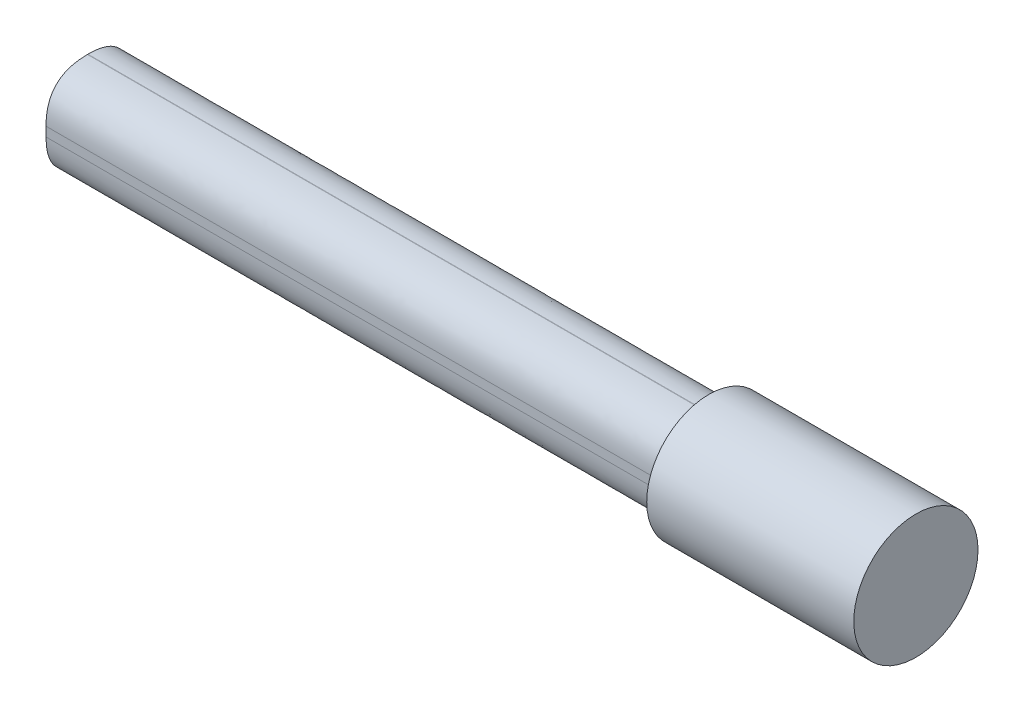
ISO-10303-21;
HEADER;
FILE_DESCRIPTION(('STEP AP214'),'2;1');
FILE_NAME('part.step','',(''),(''),'','','');
FILE_SCHEMA(('AUTOMOTIVE_DESIGN { 1 0 10303 214 1 1 1 1 }'));
ENDSEC;
DATA;
#1=APPLICATION_CONTEXT('core data for automotive mechanical design processes');
#2=APPLICATION_PROTOCOL_DEFINITION('international standard','automotive_design',2000,#1);
#3=PRODUCT_CONTEXT('',#1,'mechanical');
#4=PRODUCT('Part','Part','',(#3));
#5=PRODUCT_RELATED_PRODUCT_CATEGORY('part','',(#4));
#6=PRODUCT_DEFINITION_FORMATION('','',#4);
#7=PRODUCT_DEFINITION_CONTEXT('part definition',#1,'design');
#8=PRODUCT_DEFINITION('design','',#6,#7);
#9=PRODUCT_DEFINITION_SHAPE('','',#8);
#10=(LENGTH_UNIT() NAMED_UNIT(*) SI_UNIT(.MILLI.,.METRE.));
#11=(NAMED_UNIT(*) PLANE_ANGLE_UNIT() SI_UNIT($,.RADIAN.));
#12=(NAMED_UNIT(*) SI_UNIT($,.STERADIAN.) SOLID_ANGLE_UNIT());
#13=UNCERTAINTY_MEASURE_WITH_UNIT(LENGTH_MEASURE(1.E-05),#10,'distance_accuracy_value','');
#14=(GEOMETRIC_REPRESENTATION_CONTEXT(3) GLOBAL_UNCERTAINTY_ASSIGNED_CONTEXT((#13)) GLOBAL_UNIT_ASSIGNED_CONTEXT((#10,
#11,#12)) REPRESENTATION_CONTEXT('',''));
#15=CARTESIAN_POINT('',(0.,0.,0.));
#16=DIRECTION('',(0.,0.,1.));
#17=DIRECTION('',(1.,0.,0.));
#18=AXIS2_PLACEMENT_3D('',#15,#16,#17);
#19=CARTESIAN_POINT('',(0.,0.,0.));
#20=DIRECTION('',(1.,0.,0.));
#21=DIRECTION('',(0.,0.,-1.));
#22=AXIS2_PLACEMENT_3D('',#19,#20,#21);
#23=PLANE('',#22);
#24=CARTESIAN_POINT('',(0.,0.,0.));
#25=DIRECTION('',(1.,0.,0.));
#26=DIRECTION('',(0.,0.,-1.));
#27=AXIS2_PLACEMENT_3D('',#24,#25,#26);
#28=CIRCLE('',#27,3.81);
#29=CARTESIAN_POINT('',(0.,2.8250273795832,2.55642725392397));
#30=VERTEX_POINT('',#29);
#31=CARTESIAN_POINT('',(0.,-2.82502737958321,2.55642725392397));
#32=VERTEX_POINT('',#31);
#33=EDGE_CURVE('E122',#30,#32,#28,.T.);
#34=ORIENTED_EDGE('',*,*,#33,.F.);
#35=CARTESIAN_POINT('',(0.,2.8250273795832,-2.55642725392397));
#36=VERTEX_POINT('',#35);
#37=EDGE_CURVE('E127',#36,#30,#28,.T.);
#38=ORIENTED_EDGE('',*,*,#37,.F.);
#39=CARTESIAN_POINT('',(0.,-2.82502737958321,-2.55642725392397));
#40=VERTEX_POINT('',#39);
#41=EDGE_CURVE('E131',#40,#36,#28,.T.);
#42=ORIENTED_EDGE('',*,*,#41,.F.);
#43=EDGE_CURVE('E125',#32,#40,#28,.T.);
#44=ORIENTED_EDGE('',*,*,#43,.F.);
#45=EDGE_LOOP('',(#34,#38,#42,#44));
#46=FACE_BOUND('',#45,.T.);
#47=DIRECTION('',(0.,1.,0.));
#48=VECTOR('',#47,1.);
#49=CARTESIAN_POINT('',(0.,2.8250273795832,2.55642725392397));
#50=LINE('',#49,#48);
#51=CARTESIAN_POINT('',(0.,-0.285027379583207,2.55642725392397));
#52=VERTEX_POINT('',#51);
#53=CARTESIAN_POINT('',(0.,0.285027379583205,2.55642725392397));
#54=VERTEX_POINT('',#53);
#55=EDGE_CURVE('E59',#52,#54,#50,.T.);
#56=ORIENTED_EDGE('',*,*,#55,.F.);
#57=CARTESIAN_POINT('',(0.,-2.82502737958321,0.0164272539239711));
#58=CARTESIAN_POINT('',(0.,-2.82502737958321,2.55642725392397));
#59=CARTESIAN_POINT('',(0.,-0.285027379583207,2.55642725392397));
#60=(BOUNDED_CURVE() B_SPLINE_CURVE(2,(#57,#58,#59),.UNSPECIFIED.,.F.,
.F.) B_SPLINE_CURVE_WITH_KNOTS((3,3),(0.,1.),
.UNSPECIFIED.) CURVE() GEOMETRIC_REPRESENTATION_ITEM() RATIONAL_B_SPLINE_CURVE((1.,1.,1.)) REPRESENTATION_ITEM(''));
#61=CARTESIAN_POINT('',(0.,-2.82502737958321,0.0164272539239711));
#62=VERTEX_POINT('',#61);
#63=EDGE_CURVE('E192',#52,#62,#60,.F.);
#64=ORIENTED_EDGE('',*,*,#63,.T.);
#65=DIRECTION('',(0.,0.,1.));
#66=VECTOR('',#65,1.);
#67=CARTESIAN_POINT('',(0.,-2.82502737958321,2.55642725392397));
#68=LINE('',#67,#66);
#69=CARTESIAN_POINT('',(0.,-2.82502737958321,-0.0164272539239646));
#70=VERTEX_POINT('',#69);
#71=EDGE_CURVE('E139',#70,#62,#68,.T.);
#72=ORIENTED_EDGE('',*,*,#71,.F.);
#73=CARTESIAN_POINT('',(0.,-0.285027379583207,-2.55642725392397));
#74=CARTESIAN_POINT('',(0.,-2.82502737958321,-2.55642725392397));
#75=CARTESIAN_POINT('',(0.,-2.82502737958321,-0.0164272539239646));
#76=(BOUNDED_CURVE() B_SPLINE_CURVE(2,(#73,#74,#75),.UNSPECIFIED.,.F.,
.F.) B_SPLINE_CURVE_WITH_KNOTS((3,3),(0.,1.),
.UNSPECIFIED.) CURVE() GEOMETRIC_REPRESENTATION_ITEM() RATIONAL_B_SPLINE_CURVE((1.,1.,1.)) REPRESENTATION_ITEM(''));
#77=CARTESIAN_POINT('',(0.,-0.285027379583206,-2.55642725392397));
#78=VERTEX_POINT('',#77);
#79=EDGE_CURVE('E447',#70,#78,#76,.F.);
#80=ORIENTED_EDGE('',*,*,#79,.T.);
#81=DIRECTION('',(0.,-1.,0.));
#82=VECTOR('',#81,1.);
#83=CARTESIAN_POINT('',(0.,2.8250273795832,-2.55642725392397));
#84=LINE('',#83,#82);
#85=CARTESIAN_POINT('',(0.,0.285027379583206,-2.55642725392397));
#86=VERTEX_POINT('',#85);
#87=EDGE_CURVE('E362',#86,#78,#84,.T.);
#88=ORIENTED_EDGE('',*,*,#87,.F.);
#89=CARTESIAN_POINT('',(0.,2.8250273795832,-0.0164272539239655));
#90=CARTESIAN_POINT('',(0.,2.8250273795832,-2.55642725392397));
#91=CARTESIAN_POINT('',(0.,0.285027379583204,-2.55642725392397));
#92=(BOUNDED_CURVE() B_SPLINE_CURVE(2,(#89,#90,#91),.UNSPECIFIED.,.F.,
.F.) B_SPLINE_CURVE_WITH_KNOTS((3,3),(0.,1.),
.UNSPECIFIED.) CURVE() GEOMETRIC_REPRESENTATION_ITEM() RATIONAL_B_SPLINE_CURVE((1.,1.,1.)) REPRESENTATION_ITEM(''));
#93=CARTESIAN_POINT('',(0.,2.8250273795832,-0.0164272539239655));
#94=VERTEX_POINT('',#93);
#95=EDGE_CURVE('E52',#86,#94,#92,.F.);
#96=ORIENTED_EDGE('',*,*,#95,.T.);
#97=DIRECTION('',(0.,0.,-1.));
#98=VECTOR('',#97,1.);
#99=CARTESIAN_POINT('',(0.,2.8250273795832,2.55642725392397));
#100=LINE('',#99,#98);
#101=CARTESIAN_POINT('',(0.,2.8250273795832,0.0164272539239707));
#102=VERTEX_POINT('',#101);
#103=EDGE_CURVE('E66',#102,#94,#100,.T.);
#104=ORIENTED_EDGE('',*,*,#103,.F.);
#105=CARTESIAN_POINT('',(0.,0.285027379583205,2.55642725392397));
#106=CARTESIAN_POINT('',(0.,2.8250273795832,2.55642725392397));
#107=CARTESIAN_POINT('',(0.,2.8250273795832,0.0164272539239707));
#108=(BOUNDED_CURVE() B_SPLINE_CURVE(2,(#105,#106,#107),.UNSPECIFIED.,.F.,
.F.) B_SPLINE_CURVE_WITH_KNOTS((3,3),(0.,1.),
.UNSPECIFIED.) CURVE() GEOMETRIC_REPRESENTATION_ITEM() RATIONAL_B_SPLINE_CURVE((1.,1.,1.)) REPRESENTATION_ITEM(''));
#109=EDGE_CURVE('E12',#102,#54,#108,.F.);
#110=ORIENTED_EDGE('',*,*,#109,.T.);
#111=EDGE_LOOP('',(#56,#64,#72,#80,#88,#96,#104,#110));
#112=FACE_BOUND('',#111,.T.);
#113=ADVANCED_FACE('F38',(#46,#112),#23,.F.);
#114=CARTESIAN_POINT('',(12.7,0.,0.));
#115=DIRECTION('',(-1.,0.,0.));
#116=DIRECTION('',(0.,0.,1.));
#117=AXIS2_PLACEMENT_3D('',#114,#115,#116);
#118=CYLINDRICAL_SURFACE('',#117,3.81);
#119=CARTESIAN_POINT('',(12.7,0.,0.));
#120=DIRECTION('',(1.,0.,0.));
#121=DIRECTION('',(0.,0.,-1.));
#122=AXIS2_PLACEMENT_3D('',#119,#120,#121);
#123=CIRCLE('',#122,3.81);
#124=CARTESIAN_POINT('',(12.7,0.,-3.81));
#125=VERTEX_POINT('',#124);
#126=EDGE_CURVE('E135',#125,#125,#123,.T.);
#127=ORIENTED_EDGE('',*,*,#126,.F.);
#128=EDGE_LOOP('',(#127));
#129=FACE_BOUND('',#128,.T.);
#130=ORIENTED_EDGE('',*,*,#37,.T.);
#131=ORIENTED_EDGE('',*,*,#33,.T.);
#132=ORIENTED_EDGE('',*,*,#43,.T.);
#133=ORIENTED_EDGE('',*,*,#41,.T.);
#134=EDGE_LOOP('',(#130,#131,#132,#133));
#135=FACE_BOUND('',#134,.T.);
#136=ADVANCED_FACE('F124',(#129,#135),#118,.T.);
#137=CARTESIAN_POINT('',(12.7,0.,0.));
#138=DIRECTION('',(1.,0.,0.));
#139=DIRECTION('',(0.,0.,-1.));
#140=AXIS2_PLACEMENT_3D('',#137,#138,#139);
#141=PLANE('',#140);
#142=ORIENTED_EDGE('',*,*,#126,.T.);
#143=EDGE_LOOP('',(#142));
#144=FACE_BOUND('',#143,.T.);
#145=ADVANCED_FACE('F209',(#144),#141,.T.);
#146=CARTESIAN_POINT('',(-38.1,2.8250273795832,-2.55642725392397));
#147=DIRECTION('',(0.,0.,1.));
#148=DIRECTION('',(0.,-1.,0.));
#149=AXIS2_PLACEMENT_3D('',#146,#147,#148);
#150=PLANE('',#149);
#151=ORIENTED_EDGE('',*,*,#87,.T.);
#152=CARTESIAN_POINT('',(-40.005,-0.285027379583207,-2.55642725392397));
#153=CARTESIAN_POINT('',(-26.035,-0.285027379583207,-2.55642725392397));
#154=CARTESIAN_POINT('',(-12.065,-0.285027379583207,-2.55642725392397));
#155=CARTESIAN_POINT('',(1.905,-0.285027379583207,-2.55642725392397));
#156=(BOUNDED_CURVE() B_SPLINE_CURVE(3,(#152,#153,#154,#155),.UNSPECIFIED.,.F.,
.F.) B_SPLINE_CURVE_WITH_KNOTS((4,4),(-0.001905,0.040005),
.UNSPECIFIED.) CURVE() GEOMETRIC_REPRESENTATION_ITEM() RATIONAL_B_SPLINE_CURVE((1.,1.,1.,1.)) REPRESENTATION_ITEM(''));
#157=CARTESIAN_POINT('',(-38.1,-0.285027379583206,-2.55642725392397));
#158=VERTEX_POINT('',#157);
#159=EDGE_CURVE('E451',#78,#158,#156,.F.);
#160=ORIENTED_EDGE('',*,*,#159,.T.);
#161=DIRECTION('',(0.,-1.,0.));
#162=VECTOR('',#161,1.);
#163=CARTESIAN_POINT('',(-38.1,2.8250273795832,-2.55642725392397));
#164=LINE('',#163,#162);
#165=CARTESIAN_POINT('',(-38.1,0.285027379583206,-2.55642725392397));
#166=VERTEX_POINT('',#165);
#167=EDGE_CURVE('E151',#166,#158,#164,.T.);
#168=ORIENTED_EDGE('',*,*,#167,.F.);
#169=CARTESIAN_POINT('',(1.905,0.285027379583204,-2.55642725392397));
#170=CARTESIAN_POINT('',(-12.065,0.285027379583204,-2.55642725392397));
#171=CARTESIAN_POINT('',(-26.035,0.285027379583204,-2.55642725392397));
#172=CARTESIAN_POINT('',(-40.005,0.285027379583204,-2.55642725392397));
#173=(BOUNDED_CURVE() B_SPLINE_CURVE(3,(#169,#170,#171,#172),.UNSPECIFIED.,.F.,
.F.) B_SPLINE_CURVE_WITH_KNOTS((4,4),(-0.001905,0.040005),
.UNSPECIFIED.) CURVE() GEOMETRIC_REPRESENTATION_ITEM() RATIONAL_B_SPLINE_CURVE((1.,1.,1.,1.)) REPRESENTATION_ITEM(''));
#174=EDGE_CURVE('E326',#166,#86,#173,.F.);
#175=ORIENTED_EDGE('',*,*,#174,.T.);
#176=EDGE_LOOP('',(#151,#160,#168,#175));
#177=FACE_BOUND('',#176,.T.);
#178=ADVANCED_FACE('F417',(#177),#150,.F.);
#179=CARTESIAN_POINT('',(-38.1,-2.82502737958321,2.55642725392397));
#180=DIRECTION('',(0.,1.,0.));
#181=DIRECTION('',(0.,0.,1.));
#182=AXIS2_PLACEMENT_3D('',#179,#180,#181);
#183=PLANE('',#182);
#184=ORIENTED_EDGE('',*,*,#71,.T.);
#185=CARTESIAN_POINT('',(-40.005,-2.82502737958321,0.0164272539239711));
#186=CARTESIAN_POINT('',(-26.035,-2.82502737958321,0.0164272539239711));
#187=CARTESIAN_POINT('',(-12.065,-2.82502737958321,0.0164272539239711));
#188=CARTESIAN_POINT('',(1.905,-2.82502737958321,0.0164272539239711));
#189=(BOUNDED_CURVE() B_SPLINE_CURVE(3,(#185,#186,#187,#188),.UNSPECIFIED.,.F.,
.F.) B_SPLINE_CURVE_WITH_KNOTS((4,4),(-0.001905,0.040005),
.UNSPECIFIED.) CURVE() GEOMETRIC_REPRESENTATION_ITEM() RATIONAL_B_SPLINE_CURVE((1.,1.,1.,1.)) REPRESENTATION_ITEM(''));
#190=CARTESIAN_POINT('',(-38.1,-2.82502737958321,0.0164272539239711));
#191=VERTEX_POINT('',#190);
#192=EDGE_CURVE('E334',#62,#191,#189,.F.);
#193=ORIENTED_EDGE('',*,*,#192,.T.);
#194=DIRECTION('',(0.,0.,1.));
#195=VECTOR('',#194,1.);
#196=CARTESIAN_POINT('',(-38.1,-2.82502737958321,2.55642725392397));
#197=LINE('',#196,#195);
#198=CARTESIAN_POINT('',(-38.1,-2.82502737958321,-0.0164272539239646));
#199=VERTEX_POINT('',#198);
#200=EDGE_CURVE('E363',#199,#191,#197,.T.);
#201=ORIENTED_EDGE('',*,*,#200,.F.);
#202=CARTESIAN_POINT('',(1.905,-2.82502737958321,-0.0164272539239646));
#203=CARTESIAN_POINT('',(-12.065,-2.82502737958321,-0.0164272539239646));
#204=CARTESIAN_POINT('',(-26.035,-2.82502737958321,-0.0164272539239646));
#205=CARTESIAN_POINT('',(-40.005,-2.82502737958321,-0.0164272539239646));
#206=(BOUNDED_CURVE() B_SPLINE_CURVE(3,(#202,#203,#204,#205),.UNSPECIFIED.,.F.,
.F.) B_SPLINE_CURVE_WITH_KNOTS((4,4),(-0.001905,0.040005),
.UNSPECIFIED.) CURVE() GEOMETRIC_REPRESENTATION_ITEM() RATIONAL_B_SPLINE_CURVE((1.,1.,1.,1.)) REPRESENTATION_ITEM(''));
#207=EDGE_CURVE('E336',#199,#70,#206,.F.);
#208=ORIENTED_EDGE('',*,*,#207,.T.);
#209=EDGE_LOOP('',(#184,#193,#201,#208));
#210=FACE_BOUND('',#209,.T.);
#211=ADVANCED_FACE('F425',(#210),#183,.F.);
#212=CARTESIAN_POINT('',(-38.1,2.8250273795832,2.55642725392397));
#213=DIRECTION('',(0.,0.,-1.));
#214=DIRECTION('',(0.,1.,0.));
#215=AXIS2_PLACEMENT_3D('',#212,#213,#214);
#216=PLANE('',#215);
#217=DIRECTION('',(0.,1.,0.));
#218=VECTOR('',#217,1.);
#219=CARTESIAN_POINT('',(-38.1,2.8250273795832,2.55642725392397));
#220=LINE('',#219,#218);
#221=CARTESIAN_POINT('',(-38.1,-0.285027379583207,2.55642725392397));
#222=VERTEX_POINT('',#221);
#223=CARTESIAN_POINT('',(-38.1,0.285027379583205,2.55642725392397));
#224=VERTEX_POINT('',#223);
#225=EDGE_CURVE('E140',#222,#224,#220,.T.);
#226=ORIENTED_EDGE('',*,*,#225,.F.);
#227=CARTESIAN_POINT('',(1.905,-0.285027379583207,2.55642725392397));
#228=CARTESIAN_POINT('',(-12.065,-0.285027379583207,2.55642725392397));
#229=CARTESIAN_POINT('',(-26.035,-0.285027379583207,2.55642725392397));
#230=CARTESIAN_POINT('',(-40.005,-0.285027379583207,2.55642725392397));
#231=(BOUNDED_CURVE() B_SPLINE_CURVE(3,(#227,#228,#229,#230),.UNSPECIFIED.,.F.,
.F.) B_SPLINE_CURVE_WITH_KNOTS((4,4),(-0.001905,0.040005),
.UNSPECIFIED.) CURVE() GEOMETRIC_REPRESENTATION_ITEM() RATIONAL_B_SPLINE_CURVE((1.,1.,1.,1.)) REPRESENTATION_ITEM(''));
#232=EDGE_CURVE('E246',#222,#52,#231,.F.);
#233=ORIENTED_EDGE('',*,*,#232,.T.);
#234=ORIENTED_EDGE('',*,*,#55,.T.);
#235=CARTESIAN_POINT('',(-40.005,0.285027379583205,2.55642725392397));
#236=CARTESIAN_POINT('',(-26.035,0.285027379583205,2.55642725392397));
#237=CARTESIAN_POINT('',(-12.065,0.285027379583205,2.55642725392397));
#238=CARTESIAN_POINT('',(1.905,0.285027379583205,2.55642725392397));
#239=(BOUNDED_CURVE() B_SPLINE_CURVE(3,(#235,#236,#237,#238),.UNSPECIFIED.,.F.,
.F.) B_SPLINE_CURVE_WITH_KNOTS((4,4),(-0.001905,0.040005),
.UNSPECIFIED.) CURVE() GEOMETRIC_REPRESENTATION_ITEM() RATIONAL_B_SPLINE_CURVE((1.,1.,1.,1.)) REPRESENTATION_ITEM(''));
#240=EDGE_CURVE('E241',#54,#224,#239,.F.);
#241=ORIENTED_EDGE('',*,*,#240,.T.);
#242=EDGE_LOOP('',(#226,#233,#234,#241));
#243=FACE_BOUND('',#242,.T.);
#244=ADVANCED_FACE('F176',(#243),#216,.F.);
#245=CARTESIAN_POINT('',(-38.1,2.8250273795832,2.55642725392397));
#246=DIRECTION('',(0.,-1.,0.));
#247=DIRECTION('',(0.,0.,-1.));
#248=AXIS2_PLACEMENT_3D('',#245,#246,#247);
#249=PLANE('',#248);
#250=ORIENTED_EDGE('',*,*,#103,.T.);
#251=CARTESIAN_POINT('',(-40.005,2.8250273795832,-0.0164272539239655));
#252=CARTESIAN_POINT('',(-26.035,2.8250273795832,-0.0164272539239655));
#253=CARTESIAN_POINT('',(-12.065,2.8250273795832,-0.0164272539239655));
#254=CARTESIAN_POINT('',(1.905,2.8250273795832,-0.0164272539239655));
#255=(BOUNDED_CURVE() B_SPLINE_CURVE(3,(#251,#252,#253,#254),.UNSPECIFIED.,.F.,
.F.) B_SPLINE_CURVE_WITH_KNOTS((4,4),(-0.001905,0.040005),
.UNSPECIFIED.) CURVE() GEOMETRIC_REPRESENTATION_ITEM() RATIONAL_B_SPLINE_CURVE((1.,1.,1.,1.)) REPRESENTATION_ITEM(''));
#256=CARTESIAN_POINT('',(-38.1,2.8250273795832,-0.0164272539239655));
#257=VERTEX_POINT('',#256);
#258=EDGE_CURVE('E324',#94,#257,#255,.F.);
#259=ORIENTED_EDGE('',*,*,#258,.T.);
#260=DIRECTION('',(0.,0.,-1.));
#261=VECTOR('',#260,1.);
#262=CARTESIAN_POINT('',(-38.1,2.8250273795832,2.55642725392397));
#263=LINE('',#262,#261);
#264=CARTESIAN_POINT('',(-38.1,2.8250273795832,0.0164272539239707));
#265=VERTEX_POINT('',#264);
#266=EDGE_CURVE('E132',#265,#257,#263,.T.);
#267=ORIENTED_EDGE('',*,*,#266,.F.);
#268=CARTESIAN_POINT('',(1.905,2.8250273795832,0.0164272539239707));
#269=CARTESIAN_POINT('',(-12.065,2.8250273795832,0.0164272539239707));
#270=CARTESIAN_POINT('',(-26.035,2.8250273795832,0.0164272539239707));
#271=CARTESIAN_POINT('',(-40.005,2.8250273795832,0.0164272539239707));
#272=(BOUNDED_CURVE() B_SPLINE_CURVE(3,(#268,#269,#270,#271),.UNSPECIFIED.,.F.,
.F.) B_SPLINE_CURVE_WITH_KNOTS((4,4),(-0.001905,0.040005),
.UNSPECIFIED.) CURVE() GEOMETRIC_REPRESENTATION_ITEM() RATIONAL_B_SPLINE_CURVE((1.,1.,1.,1.)) REPRESENTATION_ITEM(''));
#273=EDGE_CURVE('E159',#265,#102,#272,.F.);
#274=ORIENTED_EDGE('',*,*,#273,.T.);
#275=EDGE_LOOP('',(#250,#259,#267,#274));
#276=FACE_BOUND('',#275,.T.);
#277=ADVANCED_FACE('F165',(#276),#249,.F.);
#278=CARTESIAN_POINT('',(-38.1,0.,0.));
#279=DIRECTION('',(1.,0.,0.));
#280=DIRECTION('',(0.,0.,-1.));
#281=AXIS2_PLACEMENT_3D('',#278,#279,#280);
#282=PLANE('',#281);
#283=ORIENTED_EDGE('',*,*,#200,.T.);
#284=CARTESIAN_POINT('',(-38.1,-0.285027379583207,2.55642725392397));
#285=CARTESIAN_POINT('',(-38.1,-2.82502737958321,2.55642725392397));
#286=CARTESIAN_POINT('',(-38.1,-2.82502737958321,0.0164272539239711));
#287=(BOUNDED_CURVE() B_SPLINE_CURVE(2,(#284,#285,#286),.UNSPECIFIED.,.F.,
.F.) B_SPLINE_CURVE_WITH_KNOTS((3,3),(0.,1.),
.UNSPECIFIED.) CURVE() GEOMETRIC_REPRESENTATION_ITEM() RATIONAL_B_SPLINE_CURVE((1.,1.,1.)) REPRESENTATION_ITEM(''));
#288=EDGE_CURVE('E333',#191,#222,#287,.F.);
#289=ORIENTED_EDGE('',*,*,#288,.T.);
#290=ORIENTED_EDGE('',*,*,#225,.T.);
#291=CARTESIAN_POINT('',(-38.1,2.8250273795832,0.0164272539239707));
#292=CARTESIAN_POINT('',(-38.1,2.8250273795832,2.55642725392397));
#293=CARTESIAN_POINT('',(-38.1,0.285027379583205,2.55642725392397));
#294=(BOUNDED_CURVE() B_SPLINE_CURVE(2,(#291,#292,#293),.UNSPECIFIED.,.F.,
.F.) B_SPLINE_CURVE_WITH_KNOTS((3,3),(0.,1.),
.UNSPECIFIED.) CURVE() GEOMETRIC_REPRESENTATION_ITEM() RATIONAL_B_SPLINE_CURVE((1.,1.,1.)) REPRESENTATION_ITEM(''));
#295=EDGE_CURVE('E242',#224,#265,#294,.F.);
#296=ORIENTED_EDGE('',*,*,#295,.T.);
#297=ORIENTED_EDGE('',*,*,#266,.T.);
#298=CARTESIAN_POINT('',(-38.1,0.285027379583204,-2.55642725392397));
#299=CARTESIAN_POINT('',(-38.1,2.8250273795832,-2.55642725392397));
#300=CARTESIAN_POINT('',(-38.1,2.8250273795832,-0.0164272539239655));
#301=(BOUNDED_CURVE() B_SPLINE_CURVE(2,(#298,#299,#300),.UNSPECIFIED.,.F.,
.F.) B_SPLINE_CURVE_WITH_KNOTS((3,3),(0.,1.),
.UNSPECIFIED.) CURVE() GEOMETRIC_REPRESENTATION_ITEM() RATIONAL_B_SPLINE_CURVE((1.,1.,1.)) REPRESENTATION_ITEM(''));
#302=EDGE_CURVE('E323',#257,#166,#301,.F.);
#303=ORIENTED_EDGE('',*,*,#302,.T.);
#304=ORIENTED_EDGE('',*,*,#167,.T.);
#305=CARTESIAN_POINT('',(-38.1,-2.82502737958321,-0.0164272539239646));
#306=CARTESIAN_POINT('',(-38.1,-2.82502737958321,-2.55642725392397));
#307=CARTESIAN_POINT('',(-38.1,-0.285027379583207,-2.55642725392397));
#308=(BOUNDED_CURVE() B_SPLINE_CURVE(2,(#305,#306,#307),.UNSPECIFIED.,.F.,
.F.) B_SPLINE_CURVE_WITH_KNOTS((3,3),(0.,1.),
.UNSPECIFIED.) CURVE() GEOMETRIC_REPRESENTATION_ITEM() RATIONAL_B_SPLINE_CURVE((1.,1.,1.)) REPRESENTATION_ITEM(''));
#309=EDGE_CURVE('E332',#158,#199,#308,.F.);
#310=ORIENTED_EDGE('',*,*,#309,.T.);
#311=EDGE_LOOP('',(#283,#289,#290,#296,#297,#303,#304,#310));
#312=FACE_BOUND('',#311,.T.);
#313=ADVANCED_FACE('F175',(#312),#282,.F.);
#314=CARTESIAN_POINT('',(-40.005,-0.285027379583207,2.55642725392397));
#315=CARTESIAN_POINT('',(-26.035,-0.285027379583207,2.55642725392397));
#316=CARTESIAN_POINT('',(-12.065,-0.285027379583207,2.55642725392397));
#317=CARTESIAN_POINT('',(1.905,-0.285027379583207,2.55642725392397));
#318=CARTESIAN_POINT('',(-40.005,-2.82502737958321,2.55642725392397));
#319=CARTESIAN_POINT('',(-26.035,-2.82502737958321,2.55642725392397));
#320=CARTESIAN_POINT('',(-12.065,-2.82502737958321,2.55642725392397));
#321=CARTESIAN_POINT('',(1.905,-2.82502737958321,2.55642725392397));
#322=CARTESIAN_POINT('',(-40.005,-2.82502737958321,0.0164272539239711));
#323=CARTESIAN_POINT('',(-26.035,-2.82502737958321,0.0164272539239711));
#324=CARTESIAN_POINT('',(-12.065,-2.82502737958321,0.0164272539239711));
#325=CARTESIAN_POINT('',(1.905,-2.82502737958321,0.0164272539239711));
#326=(BOUNDED_SURFACE() B_SPLINE_SURFACE(2,3,((#314,#315,#316,#317),(#318,#319,#320,#321),(#322,
#323,#324,#325)),.UNSPECIFIED.,.F.,.F.,.F.) B_SPLINE_SURFACE_WITH_KNOTS((3,3),(4,4),(0.,1.),
(-0.001905,0.040005),
.UNSPECIFIED.) GEOMETRIC_REPRESENTATION_ITEM() RATIONAL_B_SPLINE_SURFACE(((1.,1.,1.,1.),(1.,1.,
1.,1.),(1.,1.,1.,1.))) REPRESENTATION_ITEM('') SURFACE());
#327=ORIENTED_EDGE('',*,*,#288,.F.);
#328=ORIENTED_EDGE('',*,*,#192,.F.);
#329=ORIENTED_EDGE('',*,*,#63,.F.);
#330=ORIENTED_EDGE('',*,*,#232,.F.);
#331=EDGE_LOOP('',(#327,#328,#329,#330));
#332=FACE_BOUND('',#331,.T.);
#333=ADVANCED_FACE('F493',(#332),#326,.T.);
#334=CARTESIAN_POINT('',(-40.005,-2.82502737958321,-0.0164272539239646));
#335=CARTESIAN_POINT('',(-26.035,-2.82502737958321,-0.0164272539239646));
#336=CARTESIAN_POINT('',(-12.065,-2.82502737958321,-0.0164272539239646));
#337=CARTESIAN_POINT('',(1.905,-2.82502737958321,-0.0164272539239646));
#338=CARTESIAN_POINT('',(-40.005,-2.82502737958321,-2.55642725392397));
#339=CARTESIAN_POINT('',(-26.035,-2.82502737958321,-2.55642725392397));
#340=CARTESIAN_POINT('',(-12.065,-2.82502737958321,-2.55642725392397));
#341=CARTESIAN_POINT('',(1.905,-2.82502737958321,-2.55642725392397));
#342=CARTESIAN_POINT('',(-40.005,-0.285027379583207,-2.55642725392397));
#343=CARTESIAN_POINT('',(-26.035,-0.285027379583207,-2.55642725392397));
#344=CARTESIAN_POINT('',(-12.065,-0.285027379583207,-2.55642725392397));
#345=CARTESIAN_POINT('',(1.905,-0.285027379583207,-2.55642725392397));
#346=(BOUNDED_SURFACE() B_SPLINE_SURFACE(2,3,((#334,#335,#336,#337),(#338,#339,#340,#341),(#342,
#343,#344,#345)),.UNSPECIFIED.,.F.,.F.,.F.) B_SPLINE_SURFACE_WITH_KNOTS((3,3),(4,4),(0.,1.),
(-0.001905,0.040005),
.UNSPECIFIED.) GEOMETRIC_REPRESENTATION_ITEM() RATIONAL_B_SPLINE_SURFACE(((1.,1.,1.,1.),(1.,1.,
1.,1.),(1.,1.,1.,1.))) REPRESENTATION_ITEM('') SURFACE());
#347=ORIENTED_EDGE('',*,*,#309,.F.);
#348=ORIENTED_EDGE('',*,*,#159,.F.);
#349=ORIENTED_EDGE('',*,*,#79,.F.);
#350=ORIENTED_EDGE('',*,*,#207,.F.);
#351=EDGE_LOOP('',(#347,#348,#349,#350));
#352=FACE_BOUND('',#351,.T.);
#353=ADVANCED_FACE('F292',(#352),#346,.T.);
#354=CARTESIAN_POINT('',(-40.005,0.285027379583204,-2.55642725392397));
#355=CARTESIAN_POINT('',(-26.035,0.285027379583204,-2.55642725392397));
#356=CARTESIAN_POINT('',(-12.065,0.285027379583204,-2.55642725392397));
#357=CARTESIAN_POINT('',(1.905,0.285027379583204,-2.55642725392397));
#358=CARTESIAN_POINT('',(-40.005,2.8250273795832,-2.55642725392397));
#359=CARTESIAN_POINT('',(-26.035,2.8250273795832,-2.55642725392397));
#360=CARTESIAN_POINT('',(-12.065,2.8250273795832,-2.55642725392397));
#361=CARTESIAN_POINT('',(1.905,2.8250273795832,-2.55642725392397));
#362=CARTESIAN_POINT('',(-40.005,2.8250273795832,-0.0164272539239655));
#363=CARTESIAN_POINT('',(-26.035,2.8250273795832,-0.0164272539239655));
#364=CARTESIAN_POINT('',(-12.065,2.8250273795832,-0.0164272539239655));
#365=CARTESIAN_POINT('',(1.905,2.8250273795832,-0.0164272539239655));
#366=(BOUNDED_SURFACE() B_SPLINE_SURFACE(2,3,((#354,#355,#356,#357),(#358,#359,#360,#361),(#362,
#363,#364,#365)),.UNSPECIFIED.,.F.,.F.,.F.) B_SPLINE_SURFACE_WITH_KNOTS((3,3),(4,4),(0.,1.),
(-0.001905,0.040005),
.UNSPECIFIED.) GEOMETRIC_REPRESENTATION_ITEM() RATIONAL_B_SPLINE_SURFACE(((1.,1.,1.,1.),(1.,1.,
1.,1.),(1.,1.,1.,1.))) REPRESENTATION_ITEM('') SURFACE());
#367=ORIENTED_EDGE('',*,*,#302,.F.);
#368=ORIENTED_EDGE('',*,*,#258,.F.);
#369=ORIENTED_EDGE('',*,*,#95,.F.);
#370=ORIENTED_EDGE('',*,*,#174,.F.);
#371=EDGE_LOOP('',(#367,#368,#369,#370));
#372=FACE_BOUND('',#371,.T.);
#373=ADVANCED_FACE('F278',(#372),#366,.T.);
#374=CARTESIAN_POINT('',(-40.005,2.8250273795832,0.0164272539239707));
#375=CARTESIAN_POINT('',(-26.035,2.8250273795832,0.0164272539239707));
#376=CARTESIAN_POINT('',(-12.065,2.8250273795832,0.0164272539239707));
#377=CARTESIAN_POINT('',(1.905,2.8250273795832,0.0164272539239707));
#378=CARTESIAN_POINT('',(-40.005,2.8250273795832,2.55642725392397));
#379=CARTESIAN_POINT('',(-26.035,2.8250273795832,2.55642725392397));
#380=CARTESIAN_POINT('',(-12.065,2.8250273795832,2.55642725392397));
#381=CARTESIAN_POINT('',(1.905,2.8250273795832,2.55642725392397));
#382=CARTESIAN_POINT('',(-40.005,0.285027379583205,2.55642725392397));
#383=CARTESIAN_POINT('',(-26.035,0.285027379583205,2.55642725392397));
#384=CARTESIAN_POINT('',(-12.065,0.285027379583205,2.55642725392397));
#385=CARTESIAN_POINT('',(1.905,0.285027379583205,2.55642725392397));
#386=(BOUNDED_SURFACE() B_SPLINE_SURFACE(2,3,((#374,#375,#376,#377),(#378,#379,#380,#381),(#382,
#383,#384,#385)),.UNSPECIFIED.,.F.,.F.,.F.) B_SPLINE_SURFACE_WITH_KNOTS((3,3),(4,4),(0.,1.),
(-0.001905,0.040005),
.UNSPECIFIED.) GEOMETRIC_REPRESENTATION_ITEM() RATIONAL_B_SPLINE_SURFACE(((1.,1.,1.,1.),(1.,1.,
1.,1.),(1.,1.,1.,1.))) REPRESENTATION_ITEM('') SURFACE());
#387=ORIENTED_EDGE('',*,*,#295,.F.);
#388=ORIENTED_EDGE('',*,*,#240,.F.);
#389=ORIENTED_EDGE('',*,*,#109,.F.);
#390=ORIENTED_EDGE('',*,*,#273,.F.);
#391=EDGE_LOOP('',(#387,#388,#389,#390));
#392=FACE_BOUND('',#391,.T.);
#393=ADVANCED_FACE('F41',(#392),#386,.T.);
#394=CLOSED_SHELL('',(#113,#136,#145,#178,#211,#244,#277,#313,#333,#353,#373,#393));
#395=MANIFOLD_SOLID_BREP('B2',#394);
#396=ADVANCED_BREP_SHAPE_REPRESENTATION('',(#18,#395),#14);
#397=SHAPE_DEFINITION_REPRESENTATION(#9,#396);
ENDSEC;
END-ISO-10303-21;
